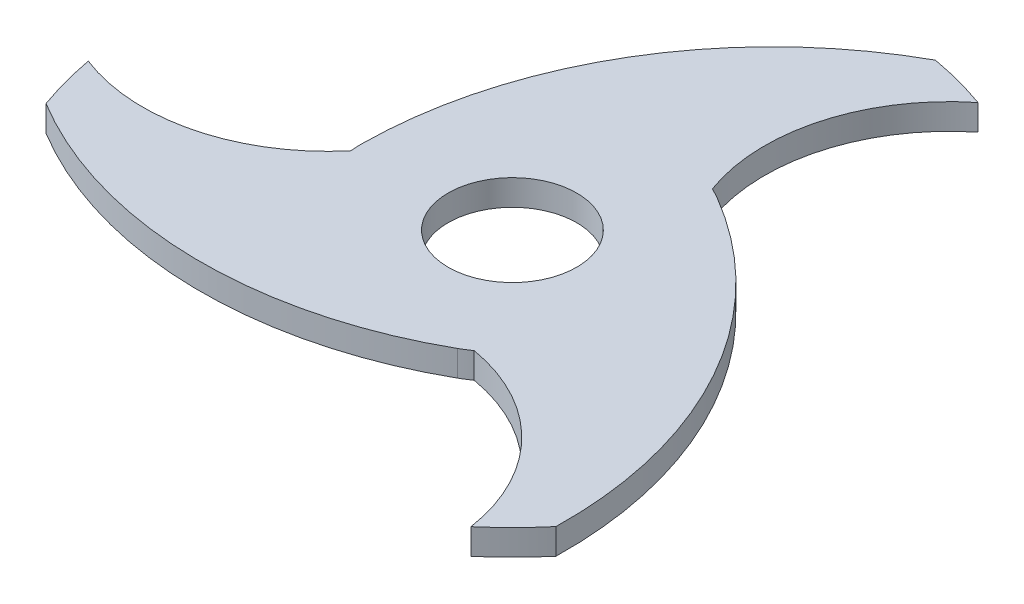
ISO-10303-21;
HEADER;
FILE_DESCRIPTION(('STEP AP214'),'2;1');
FILE_NAME('part.step','',(''),(''),'','','');
FILE_SCHEMA(('AUTOMOTIVE_DESIGN { 1 0 10303 214 1 1 1 1 }'));
ENDSEC;
DATA;
#1=APPLICATION_CONTEXT('core data for automotive mechanical design processes');
#2=APPLICATION_PROTOCOL_DEFINITION('international standard','automotive_design',2000,#1);
#3=PRODUCT_CONTEXT('',#1,'mechanical');
#4=PRODUCT('Part','Part','',(#3));
#5=PRODUCT_RELATED_PRODUCT_CATEGORY('part','',(#4));
#6=PRODUCT_DEFINITION_FORMATION('','',#4);
#7=PRODUCT_DEFINITION_CONTEXT('part definition',#1,'design');
#8=PRODUCT_DEFINITION('design','',#6,#7);
#9=PRODUCT_DEFINITION_SHAPE('','',#8);
#10=(LENGTH_UNIT() NAMED_UNIT(*) SI_UNIT(.MILLI.,.METRE.));
#11=(NAMED_UNIT(*) PLANE_ANGLE_UNIT() SI_UNIT($,.RADIAN.));
#12=(NAMED_UNIT(*) SI_UNIT($,.STERADIAN.) SOLID_ANGLE_UNIT());
#13=UNCERTAINTY_MEASURE_WITH_UNIT(LENGTH_MEASURE(1.E-05),#10,'distance_accuracy_value','');
#14=(GEOMETRIC_REPRESENTATION_CONTEXT(3) GLOBAL_UNCERTAINTY_ASSIGNED_CONTEXT((#13)) GLOBAL_UNIT_ASSIGNED_CONTEXT((#10,
#11,#12)) REPRESENTATION_CONTEXT('',''));
#15=CARTESIAN_POINT('',(0.,0.,0.));
#16=DIRECTION('',(0.,0.,1.));
#17=DIRECTION('',(1.,0.,0.));
#18=AXIS2_PLACEMENT_3D('',#15,#16,#17);
#19=CARTESIAN_POINT('',(-14.9868302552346,3.,-26.8549087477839));
#20=DIRECTION('',(0.,-1.,0.));
#21=DIRECTION('',(0.,0.,-1.));
#22=AXIS2_PLACEMENT_3D('',#19,#20,#21);
#23=CYLINDRICAL_SURFACE('',#22,48.2525325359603);
#24=CARTESIAN_POINT('',(-14.9868302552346,0.,-26.8549087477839));
#25=DIRECTION('',(0.,1.,0.));
#26=DIRECTION('',(0.,0.,1.));
#27=AXIS2_PLACEMENT_3D('',#24,#25,#26);
#28=CIRCLE('',#27,48.2525325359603);
#29=CARTESIAN_POINT('',(-39.9784418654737,0.,14.4213101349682));
#30=VERTEX_POINT('',#29);
#31=CARTESIAN_POINT('',(8.74999999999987,0.,15.1554445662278));
#32=VERTEX_POINT('',#31);
#33=EDGE_CURVE('E159',#30,#32,#28,.T.);
#34=ORIENTED_EDGE('',*,*,#33,.T.);
#35=DIRECTION('',(0.,-1.,0.));
#36=VECTOR('',#35,1.);
#37=CARTESIAN_POINT('',(8.74999999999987,3.,15.1554445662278));
#38=LINE('',#37,#36);
#39=CARTESIAN_POINT('',(8.74999999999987,3.,15.1554445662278));
#40=VERTEX_POINT('',#39);
#41=EDGE_CURVE('E11',#40,#32,#38,.T.);
#42=ORIENTED_EDGE('',*,*,#41,.F.);
#43=CARTESIAN_POINT('',(-14.9868302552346,3.,-26.8549087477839));
#44=DIRECTION('',(0.,1.,0.));
#45=DIRECTION('',(0.,0.,1.));
#46=AXIS2_PLACEMENT_3D('',#43,#44,#45);
#47=CIRCLE('',#46,48.2525325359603);
#48=CARTESIAN_POINT('',(-39.9784418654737,3.,14.4213101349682));
#49=VERTEX_POINT('',#48);
#50=EDGE_CURVE('E184',#49,#40,#47,.T.);
#51=ORIENTED_EDGE('',*,*,#50,.F.);
#52=DIRECTION('',(0.,-1.,0.));
#53=VECTOR('',#52,1.);
#54=CARTESIAN_POINT('',(-39.9784418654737,3.,14.4213101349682));
#55=LINE('',#54,#53);
#56=EDGE_CURVE('E158',#49,#30,#55,.T.);
#57=ORIENTED_EDGE('',*,*,#56,.T.);
#58=EDGE_LOOP('',(#34,#42,#51,#57));
#59=FACE_BOUND('',#58,.T.);
#60=ADVANCED_FACE('F35',(#59),#23,.T.);
#61=CARTESIAN_POINT('',(0.,3.,0.));
#62=DIRECTION('',(0.,-1.,0.));
#63=DIRECTION('',(0.,0.,-1.));
#64=AXIS2_PLACEMENT_3D('',#61,#62,#63);
#65=CYLINDRICAL_SURFACE('',#64,17.5);
#66=CARTESIAN_POINT('',(0.,0.,0.));
#67=DIRECTION('',(0.,1.,0.));
#68=DIRECTION('',(0.,0.,1.));
#69=AXIS2_PLACEMENT_3D('',#66,#67,#68);
#70=CIRCLE('',#69,17.5);
#71=CARTESIAN_POINT('',(9.94306393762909,0.,14.4008846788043));
#72=VERTEX_POINT('',#71);
#73=EDGE_CURVE('E162',#32,#72,#70,.T.);
#74=ORIENTED_EDGE('',*,*,#73,.T.);
#75=DIRECTION('',(0.,-1.,0.));
#76=VECTOR('',#75,1.);
#77=CARTESIAN_POINT('',(9.94306393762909,3.,14.4008846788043));
#78=LINE('',#77,#76);
#79=CARTESIAN_POINT('',(9.94306393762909,3.,14.4008846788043));
#80=VERTEX_POINT('',#79);
#81=EDGE_CURVE('E43',#80,#72,#78,.T.);
#82=ORIENTED_EDGE('',*,*,#81,.F.);
#83=CARTESIAN_POINT('',(0.,3.,0.));
#84=DIRECTION('',(0.,1.,0.));
#85=DIRECTION('',(0.,0.,1.));
#86=AXIS2_PLACEMENT_3D('',#83,#84,#85);
#87=CIRCLE('',#86,17.5);
#88=EDGE_CURVE('E106',#40,#80,#87,.T.);
#89=ORIENTED_EDGE('',*,*,#88,.F.);
#90=ORIENTED_EDGE('',*,*,#41,.T.);
#91=EDGE_LOOP('',(#74,#82,#89,#90));
#92=FACE_BOUND('',#91,.T.);
#93=ADVANCED_FACE('F264',(#92),#65,.T.);
#94=CARTESIAN_POINT('',(6.26150603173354,3.,35.6048556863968));
#95=DIRECTION('',(0.,-1.,0.));
#96=DIRECTION('',(0.,0.,-1.));
#97=AXIS2_PLACEMENT_3D('',#94,#95,#96);
#98=CYLINDRICAL_SURFACE('',#97,21.5212047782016);
#99=CARTESIAN_POINT('',(6.26150603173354,0.,35.6048556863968));
#100=DIRECTION('',(0.,1.,0.));
#101=DIRECTION('',(0.,0.,1.));
#102=AXIS2_PLACEMENT_3D('',#99,#100,#101);
#103=CIRCLE('',#102,21.5212047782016);
#104=CARTESIAN_POINT('',(27.5383730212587,0.,32.3710983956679));
#105=VERTEX_POINT('',#104);
#106=EDGE_CURVE('E164',#72,#105,#103,.F.);
#107=ORIENTED_EDGE('',*,*,#106,.T.);
#108=DIRECTION('',(0.,-1.,0.));
#109=VECTOR('',#108,1.);
#110=CARTESIAN_POINT('',(27.5383730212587,3.,32.3710983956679));
#111=LINE('',#110,#109);
#112=CARTESIAN_POINT('',(27.5383730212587,3.,32.3710983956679));
#113=VERTEX_POINT('',#112);
#114=EDGE_CURVE('E203',#113,#105,#111,.T.);
#115=ORIENTED_EDGE('',*,*,#114,.F.);
#116=CARTESIAN_POINT('',(6.26150603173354,3.,35.6048556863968));
#117=DIRECTION('',(0.,1.,0.));
#118=DIRECTION('',(0.,0.,1.));
#119=AXIS2_PLACEMENT_3D('',#116,#117,#118);
#120=CIRCLE('',#119,21.5212047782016);
#121=EDGE_CURVE('E211',#80,#113,#120,.F.);
#122=ORIENTED_EDGE('',*,*,#121,.F.);
#123=ORIENTED_EDGE('',*,*,#81,.T.);
#124=EDGE_LOOP('',(#107,#115,#122,#123));
#125=FACE_BOUND('',#124,.T.);
#126=ADVANCED_FACE('F209',(#125),#98,.F.);
#127=CARTESIAN_POINT('',(0.,3.,0.));
#128=DIRECTION('',(0.,-1.,0.));
#129=DIRECTION('',(0.,0.,-1.));
#130=AXIS2_PLACEMENT_3D('',#127,#128,#129);
#131=CYLINDRICAL_SURFACE('',#130,42.5);
#132=CARTESIAN_POINT('',(0.,0.,0.));
#133=DIRECTION('',(0.,1.,0.));
#134=DIRECTION('',(0.,0.,1.));
#135=AXIS2_PLACEMENT_3D('',#132,#133,#134);
#136=CIRCLE('',#135,42.5);
#137=CARTESIAN_POINT('',(32.4784418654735,0.,27.4116911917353));
#138=VERTEX_POINT('',#137);
#139=EDGE_CURVE('E166',#105,#138,#136,.T.);
#140=ORIENTED_EDGE('',*,*,#139,.T.);
#141=DIRECTION('',(0.,-1.,0.));
#142=VECTOR('',#141,1.);
#143=CARTESIAN_POINT('',(32.4784418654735,3.,27.4116911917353));
#144=LINE('',#143,#142);
#145=CARTESIAN_POINT('',(32.4784418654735,3.,27.4116911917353));
#146=VERTEX_POINT('',#145);
#147=EDGE_CURVE('E200',#146,#138,#144,.T.);
#148=ORIENTED_EDGE('',*,*,#147,.F.);
#149=CARTESIAN_POINT('',(0.,3.,0.));
#150=DIRECTION('',(0.,1.,0.));
#151=DIRECTION('',(0.,0.,1.));
#152=AXIS2_PLACEMENT_3D('',#149,#150,#151);
#153=CIRCLE('',#152,42.5);
#154=EDGE_CURVE('E230',#113,#146,#153,.T.);
#155=ORIENTED_EDGE('',*,*,#154,.F.);
#156=ORIENTED_EDGE('',*,*,#114,.T.);
#157=EDGE_LOOP('',(#140,#148,#155,#156));
#158=FACE_BOUND('',#157,.T.);
#159=ADVANCED_FACE('F221',(#158),#131,.T.);
#160=CARTESIAN_POINT('',(-15.7636180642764,3.,26.4064300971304));
#161=DIRECTION('',(0.,-1.,0.));
#162=DIRECTION('',(0.,0.,-1.));
#163=AXIS2_PLACEMENT_3D('',#160,#161,#162);
#164=CYLINDRICAL_SURFACE('',#163,48.2525325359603);
#165=CARTESIAN_POINT('',(-15.7636180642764,0.,26.4064300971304));
#166=DIRECTION('',(0.,1.,0.));
#167=DIRECTION('',(0.,0.,1.));
#168=AXIS2_PLACEMENT_3D('',#165,#166,#167);
#169=CIRCLE('',#168,48.2525325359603);
#170=CARTESIAN_POINT('',(8.75000000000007,0.,-15.1554445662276));
#171=VERTEX_POINT('',#170);
#172=EDGE_CURVE('E168',#138,#171,#169,.T.);
#173=ORIENTED_EDGE('',*,*,#172,.T.);
#174=DIRECTION('',(0.,-1.,0.));
#175=VECTOR('',#174,1.);
#176=CARTESIAN_POINT('',(8.75000000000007,3.,-15.1554445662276));
#177=LINE('',#176,#175);
#178=CARTESIAN_POINT('',(8.75000000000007,3.,-15.1554445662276));
#179=VERTEX_POINT('',#178);
#180=EDGE_CURVE('E197',#179,#171,#177,.T.);
#181=ORIENTED_EDGE('',*,*,#180,.F.);
#182=CARTESIAN_POINT('',(-15.7636180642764,3.,26.4064300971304));
#183=DIRECTION('',(0.,1.,0.));
#184=DIRECTION('',(0.,0.,1.));
#185=AXIS2_PLACEMENT_3D('',#182,#183,#184);
#186=CIRCLE('',#185,48.2525325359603);
#187=EDGE_CURVE('E227',#146,#179,#186,.T.);
#188=ORIENTED_EDGE('',*,*,#187,.F.);
#189=ORIENTED_EDGE('',*,*,#147,.T.);
#190=EDGE_LOOP('',(#173,#181,#188,#189));
#191=FACE_BOUND('',#190,.T.);
#192=ADVANCED_FACE('F225',(#191),#164,.T.);
#193=CARTESIAN_POINT('',(0.,3.,0.));
#194=DIRECTION('',(0.,-1.,0.));
#195=DIRECTION('',(0.,0.,-1.));
#196=AXIS2_PLACEMENT_3D('',#193,#194,#195);
#197=CYLINDRICAL_SURFACE('',#196,17.5);
#198=CARTESIAN_POINT('',(0.,0.,0.));
#199=DIRECTION('',(0.,1.,0.));
#200=DIRECTION('',(0.,0.,1.));
#201=AXIS2_PLACEMENT_3D('',#198,#199,#200);
#202=CIRCLE('',#201,17.5);
#203=CARTESIAN_POINT('',(7.5,0.,-15.8113883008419));
#204=VERTEX_POINT('',#203);
#205=EDGE_CURVE('E170',#171,#204,#202,.T.);
#206=ORIENTED_EDGE('',*,*,#205,.T.);
#207=DIRECTION('',(0.,-1.,0.));
#208=VECTOR('',#207,1.);
#209=CARTESIAN_POINT('',(7.5,3.,-15.8113883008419));
#210=LINE('',#209,#208);
#211=CARTESIAN_POINT('',(7.5,3.,-15.8113883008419));
#212=VERTEX_POINT('',#211);
#213=EDGE_CURVE('E194',#212,#204,#210,.T.);
#214=ORIENTED_EDGE('',*,*,#213,.F.);
#215=CARTESIAN_POINT('',(0.,3.,0.));
#216=DIRECTION('',(0.,1.,0.));
#217=DIRECTION('',(0.,0.,1.));
#218=AXIS2_PLACEMENT_3D('',#215,#216,#217);
#219=CIRCLE('',#218,17.5);
#220=EDGE_CURVE('E229',#179,#212,#219,.T.);
#221=ORIENTED_EDGE('',*,*,#220,.F.);
#222=ORIENTED_EDGE('',*,*,#180,.T.);
#223=EDGE_LOOP('',(#206,#214,#221,#222));
#224=FACE_BOUND('',#223,.T.);
#225=ADVANCED_FACE('F277',(#224),#197,.T.);
#226=CARTESIAN_POINT('',(27.7039565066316,3.,-23.2250511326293));
#227=DIRECTION('',(0.,-1.,0.));
#228=DIRECTION('',(0.,0.,-1.));
#229=AXIS2_PLACEMENT_3D('',#226,#227,#228);
#230=CYLINDRICAL_SURFACE('',#229,21.5212047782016);
#231=CARTESIAN_POINT('',(27.7039565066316,0.,-23.2250511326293));
#232=DIRECTION('',(0.,1.,0.));
#233=DIRECTION('',(0.,0.,1.));
#234=AXIS2_PLACEMENT_3D('',#231,#232,#233);
#235=CIRCLE('',#234,21.5212047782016);
#236=CARTESIAN_POINT('',(14.2650070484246,0.,-40.0344798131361));
#237=VERTEX_POINT('',#236);
#238=EDGE_CURVE('E172',#204,#237,#235,.F.);
#239=ORIENTED_EDGE('',*,*,#238,.T.);
#240=DIRECTION('',(0.,-1.,0.));
#241=VECTOR('',#240,1.);
#242=CARTESIAN_POINT('',(14.2650070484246,3.,-40.0344798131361));
#243=LINE('',#242,#241);
#244=CARTESIAN_POINT('',(14.2650070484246,3.,-40.0344798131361));
#245=VERTEX_POINT('',#244);
#246=EDGE_CURVE('E191',#245,#237,#243,.T.);
#247=ORIENTED_EDGE('',*,*,#246,.F.);
#248=CARTESIAN_POINT('',(27.7039565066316,3.,-23.2250511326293));
#249=DIRECTION('',(0.,1.,0.));
#250=DIRECTION('',(0.,0.,1.));
#251=AXIS2_PLACEMENT_3D('',#248,#249,#250);
#252=CIRCLE('',#251,21.5212047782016);
#253=EDGE_CURVE('E232',#212,#245,#252,.F.);
#254=ORIENTED_EDGE('',*,*,#253,.F.);
#255=ORIENTED_EDGE('',*,*,#213,.T.);
#256=EDGE_LOOP('',(#239,#247,#254,#255));
#257=FACE_BOUND('',#256,.T.);
#258=ADVANCED_FACE('F280',(#257),#230,.F.);
#259=CARTESIAN_POINT('',(0.,3.,0.));
#260=DIRECTION('',(0.,-1.,0.));
#261=DIRECTION('',(0.,0.,-1.));
#262=AXIS2_PLACEMENT_3D('',#259,#260,#261);
#263=CYLINDRICAL_SURFACE('',#262,42.5);
#264=CARTESIAN_POINT('',(0.,0.,0.));
#265=DIRECTION('',(0.,1.,0.));
#266=DIRECTION('',(0.,0.,1.));
#267=AXIS2_PLACEMENT_3D('',#264,#265,#266);
#268=CIRCLE('',#267,42.5);
#269=CARTESIAN_POINT('',(7.49999999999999,0.,-41.8330013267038));
#270=VERTEX_POINT('',#269);
#271=EDGE_CURVE('E174',#237,#270,#268,.T.);
#272=ORIENTED_EDGE('',*,*,#271,.T.);
#273=DIRECTION('',(0.,-1.,0.));
#274=VECTOR('',#273,1.);
#275=CARTESIAN_POINT('',(7.49999999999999,3.,-41.8330013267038));
#276=LINE('',#275,#274);
#277=CARTESIAN_POINT('',(7.49999999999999,3.,-41.8330013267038));
#278=VERTEX_POINT('',#277);
#279=EDGE_CURVE('E188',#278,#270,#276,.T.);
#280=ORIENTED_EDGE('',*,*,#279,.F.);
#281=CARTESIAN_POINT('',(0.,3.,0.));
#282=DIRECTION('',(0.,1.,0.));
#283=DIRECTION('',(0.,0.,1.));
#284=AXIS2_PLACEMENT_3D('',#281,#282,#283);
#285=CIRCLE('',#284,42.5);
#286=EDGE_CURVE('E238',#245,#278,#285,.T.);
#287=ORIENTED_EDGE('',*,*,#286,.F.);
#288=ORIENTED_EDGE('',*,*,#246,.T.);
#289=EDGE_LOOP('',(#272,#280,#287,#288));
#290=FACE_BOUND('',#289,.T.);
#291=ADVANCED_FACE('F244',(#290),#263,.T.);
#292=CARTESIAN_POINT('',(30.7504483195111,3.,0.448478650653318));
#293=DIRECTION('',(0.,-1.,0.));
#294=DIRECTION('',(0.,0.,-1.));
#295=AXIS2_PLACEMENT_3D('',#292,#293,#294);
#296=CYLINDRICAL_SURFACE('',#295,48.2525325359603);
#297=CARTESIAN_POINT('',(30.7504483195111,0.,0.448478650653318));
#298=DIRECTION('',(0.,1.,0.));
#299=DIRECTION('',(0.,0.,1.));
#300=AXIS2_PLACEMENT_3D('',#297,#298,#299);
#301=CIRCLE('',#300,48.2525325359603);
#302=CARTESIAN_POINT('',(-17.5,0.,1.03188941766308E-12));
#303=VERTEX_POINT('',#302);
#304=EDGE_CURVE('E176',#270,#303,#301,.T.);
#305=ORIENTED_EDGE('',*,*,#304,.T.);
#306=DIRECTION('',(0.,-1.,0.));
#307=VECTOR('',#306,1.);
#308=CARTESIAN_POINT('',(-17.5,3.,1.03188941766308E-12));
#309=LINE('',#308,#307);
#310=CARTESIAN_POINT('',(-17.5,3.,1.03188941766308E-12));
#311=VERTEX_POINT('',#310);
#312=EDGE_CURVE('E147',#311,#303,#309,.T.);
#313=ORIENTED_EDGE('',*,*,#312,.F.);
#314=CARTESIAN_POINT('',(30.7504483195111,3.,0.448478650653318));
#315=DIRECTION('',(0.,1.,0.));
#316=DIRECTION('',(0.,0.,1.));
#317=AXIS2_PLACEMENT_3D('',#314,#315,#316);
#318=CIRCLE('',#317,48.2525325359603);
#319=EDGE_CURVE('E138',#278,#311,#318,.T.);
#320=ORIENTED_EDGE('',*,*,#319,.F.);
#321=ORIENTED_EDGE('',*,*,#279,.T.);
#322=EDGE_LOOP('',(#305,#313,#320,#321));
#323=FACE_BOUND('',#322,.T.);
#324=ADVANCED_FACE('F248',(#323),#296,.T.);
#325=CARTESIAN_POINT('',(0.,3.,0.));
#326=DIRECTION('',(0.,-1.,0.));
#327=DIRECTION('',(0.,0.,-1.));
#328=AXIS2_PLACEMENT_3D('',#325,#326,#327);
#329=CYLINDRICAL_SURFACE('',#328,17.5);
#330=CARTESIAN_POINT('',(0.,0.,0.));
#331=DIRECTION('',(0.,1.,0.));
#332=DIRECTION('',(0.,0.,1.));
#333=AXIS2_PLACEMENT_3D('',#330,#331,#332);
#334=CIRCLE('',#333,17.5);
#335=CARTESIAN_POINT('',(-17.4430639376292,0.,1.4105036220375));
#336=VERTEX_POINT('',#335);
#337=EDGE_CURVE('E146',#303,#336,#334,.T.);
#338=ORIENTED_EDGE('',*,*,#337,.T.);
#339=DIRECTION('',(0.,-1.,0.));
#340=VECTOR('',#339,1.);
#341=CARTESIAN_POINT('',(-17.4430639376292,3.,1.4105036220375));
#342=LINE('',#341,#340);
#343=CARTESIAN_POINT('',(-17.4430639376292,3.,1.4105036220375));
#344=VERTEX_POINT('',#343);
#345=EDGE_CURVE('E143',#344,#336,#342,.T.);
#346=ORIENTED_EDGE('',*,*,#345,.F.);
#347=CARTESIAN_POINT('',(0.,3.,0.));
#348=DIRECTION('',(0.,1.,0.));
#349=DIRECTION('',(0.,0.,1.));
#350=AXIS2_PLACEMENT_3D('',#347,#348,#349);
#351=CIRCLE('',#350,17.5);
#352=EDGE_CURVE('E131',#311,#344,#351,.T.);
#353=ORIENTED_EDGE('',*,*,#352,.F.);
#354=ORIENTED_EDGE('',*,*,#312,.T.);
#355=EDGE_LOOP('',(#338,#346,#353,#354));
#356=FACE_BOUND('',#355,.T.);
#357=ADVANCED_FACE('F144',(#356),#329,.T.);
#358=CARTESIAN_POINT('',(-33.9654625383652,3.,-12.3798045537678));
#359=DIRECTION('',(0.,-1.,0.));
#360=DIRECTION('',(0.,0.,-1.));
#361=AXIS2_PLACEMENT_3D('',#358,#359,#360);
#362=CYLINDRICAL_SURFACE('',#361,21.5212047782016);
#363=CARTESIAN_POINT('',(-33.9654625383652,0.,-12.3798045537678));
#364=DIRECTION('',(0.,1.,0.));
#365=DIRECTION('',(0.,0.,1.));
#366=AXIS2_PLACEMENT_3D('',#363,#364,#365);
#367=CIRCLE('',#366,21.5212047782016);
#368=CARTESIAN_POINT('',(-41.8033800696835,0.,7.6633814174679));
#369=VERTEX_POINT('',#368);
#370=EDGE_CURVE('E92',#336,#369,#367,.F.);
#371=ORIENTED_EDGE('',*,*,#370,.T.);
#372=DIRECTION('',(0.,-1.,0.));
#373=VECTOR('',#372,1.);
#374=CARTESIAN_POINT('',(-41.8033800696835,3.,7.6633814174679));
#375=LINE('',#374,#373);
#376=CARTESIAN_POINT('',(-41.8033800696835,3.,7.6633814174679));
#377=VERTEX_POINT('',#376);
#378=EDGE_CURVE('E148',#377,#369,#375,.T.);
#379=ORIENTED_EDGE('',*,*,#378,.F.);
#380=CARTESIAN_POINT('',(-33.9654625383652,3.,-12.3798045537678));
#381=DIRECTION('',(0.,1.,0.));
#382=DIRECTION('',(0.,0.,1.));
#383=AXIS2_PLACEMENT_3D('',#380,#381,#382);
#384=CIRCLE('',#383,21.5212047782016);
#385=EDGE_CURVE('E136',#344,#377,#384,.F.);
#386=ORIENTED_EDGE('',*,*,#385,.F.);
#387=ORIENTED_EDGE('',*,*,#345,.T.);
#388=EDGE_LOOP('',(#371,#379,#386,#387));
#389=FACE_BOUND('',#388,.T.);
#390=ADVANCED_FACE('F150',(#389),#362,.F.);
#391=CARTESIAN_POINT('',(0.,3.,0.));
#392=DIRECTION('',(0.,-1.,0.));
#393=DIRECTION('',(0.,0.,-1.));
#394=AXIS2_PLACEMENT_3D('',#391,#392,#393);
#395=CYLINDRICAL_SURFACE('',#394,42.5);
#396=CARTESIAN_POINT('',(0.,0.,0.));
#397=DIRECTION('',(0.,1.,0.));
#398=DIRECTION('',(0.,0.,1.));
#399=AXIS2_PLACEMENT_3D('',#396,#397,#398);
#400=CIRCLE('',#399,42.5);
#401=EDGE_CURVE('E98',#369,#30,#400,.T.);
#402=ORIENTED_EDGE('',*,*,#401,.T.);
#403=ORIENTED_EDGE('',*,*,#56,.F.);
#404=CARTESIAN_POINT('',(0.,3.,0.));
#405=DIRECTION('',(0.,1.,0.));
#406=DIRECTION('',(0.,0.,1.));
#407=AXIS2_PLACEMENT_3D('',#404,#405,#406);
#408=CIRCLE('',#407,42.5);
#409=EDGE_CURVE('E51',#377,#49,#408,.T.);
#410=ORIENTED_EDGE('',*,*,#409,.F.);
#411=ORIENTED_EDGE('',*,*,#378,.T.);
#412=EDGE_LOOP('',(#402,#403,#410,#411));
#413=FACE_BOUND('',#412,.T.);
#414=ADVANCED_FACE('F252',(#413),#395,.T.);
#415=CARTESIAN_POINT('',(0.,3.,0.));
#416=DIRECTION('',(0.,-1.,0.));
#417=DIRECTION('',(0.,0.,-1.));
#418=AXIS2_PLACEMENT_3D('',#415,#416,#417);
#419=CYLINDRICAL_SURFACE('',#418,7.5);
#420=CARTESIAN_POINT('',(0.,3.,0.));
#421=DIRECTION('',(0.,1.,0.));
#422=DIRECTION('',(0.,0.,1.));
#423=AXIS2_PLACEMENT_3D('',#420,#421,#422);
#424=CIRCLE('',#423,7.5);
#425=CARTESIAN_POINT('',(0.,3.,7.5));
#426=VERTEX_POINT('',#425);
#427=EDGE_CURVE('E152',#426,#426,#424,.T.);
#428=ORIENTED_EDGE('',*,*,#427,.T.);
#429=EDGE_LOOP('',(#428));
#430=FACE_BOUND('',#429,.T.);
#431=CARTESIAN_POINT('',(0.,0.,0.));
#432=DIRECTION('',(0.,1.,0.));
#433=DIRECTION('',(0.,0.,1.));
#434=AXIS2_PLACEMENT_3D('',#431,#432,#433);
#435=CIRCLE('',#434,7.5);
#436=CARTESIAN_POINT('',(0.,0.,7.5));
#437=VERTEX_POINT('',#436);
#438=EDGE_CURVE('E181',#437,#437,#435,.T.);
#439=ORIENTED_EDGE('',*,*,#438,.F.);
#440=EDGE_LOOP('',(#439));
#441=FACE_BOUND('',#440,.T.);
#442=ADVANCED_FACE('F254',(#430,#441),#419,.F.);
#443=CARTESIAN_POINT('',(0.,3.,0.));
#444=DIRECTION('',(0.,1.,0.));
#445=DIRECTION('',(0.,0.,1.));
#446=AXIS2_PLACEMENT_3D('',#443,#444,#445);
#447=PLANE('',#446);
#448=ORIENTED_EDGE('',*,*,#50,.T.);
#449=ORIENTED_EDGE('',*,*,#88,.T.);
#450=ORIENTED_EDGE('',*,*,#121,.T.);
#451=ORIENTED_EDGE('',*,*,#154,.T.);
#452=ORIENTED_EDGE('',*,*,#187,.T.);
#453=ORIENTED_EDGE('',*,*,#220,.T.);
#454=ORIENTED_EDGE('',*,*,#253,.T.);
#455=ORIENTED_EDGE('',*,*,#286,.T.);
#456=ORIENTED_EDGE('',*,*,#319,.T.);
#457=ORIENTED_EDGE('',*,*,#352,.T.);
#458=ORIENTED_EDGE('',*,*,#385,.T.);
#459=ORIENTED_EDGE('',*,*,#409,.T.);
#460=EDGE_LOOP('',(#448,#449,#450,#451,#452,#453,#454,#455,#456,#457,#458,#459));
#461=FACE_BOUND('',#460,.T.);
#462=ORIENTED_EDGE('',*,*,#427,.F.);
#463=EDGE_LOOP('',(#462));
#464=FACE_BOUND('',#463,.T.);
#465=ADVANCED_FACE('F133',(#461,#464),#447,.T.);
#466=CARTESIAN_POINT('',(0.,0.,0.));
#467=DIRECTION('',(0.,1.,0.));
#468=DIRECTION('',(0.,0.,1.));
#469=AXIS2_PLACEMENT_3D('',#466,#467,#468);
#470=PLANE('',#469);
#471=ORIENTED_EDGE('',*,*,#33,.F.);
#472=ORIENTED_EDGE('',*,*,#401,.F.);
#473=ORIENTED_EDGE('',*,*,#370,.F.);
#474=ORIENTED_EDGE('',*,*,#337,.F.);
#475=ORIENTED_EDGE('',*,*,#304,.F.);
#476=ORIENTED_EDGE('',*,*,#271,.F.);
#477=ORIENTED_EDGE('',*,*,#238,.F.);
#478=ORIENTED_EDGE('',*,*,#205,.F.);
#479=ORIENTED_EDGE('',*,*,#172,.F.);
#480=ORIENTED_EDGE('',*,*,#139,.F.);
#481=ORIENTED_EDGE('',*,*,#106,.F.);
#482=ORIENTED_EDGE('',*,*,#73,.F.);
#483=EDGE_LOOP('',(#471,#472,#473,#474,#475,#476,#477,#478,#479,#480,#481,#482));
#484=FACE_BOUND('',#483,.T.);
#485=ORIENTED_EDGE('',*,*,#438,.T.);
#486=EDGE_LOOP('',(#485));
#487=FACE_BOUND('',#486,.T.);
#488=ADVANCED_FACE('F215',(#484,#487),#470,.F.);
#489=CLOSED_SHELL('',(#60,#93,#126,#159,#192,#225,#258,#291,#324,#357,#390,#414,#442,#465,#488));
#490=MANIFOLD_SOLID_BREP('B2',#489);
#491=ADVANCED_BREP_SHAPE_REPRESENTATION('',(#18,#490),#14);
#492=SHAPE_DEFINITION_REPRESENTATION(#9,#491);
ENDSEC;
END-ISO-10303-21;
